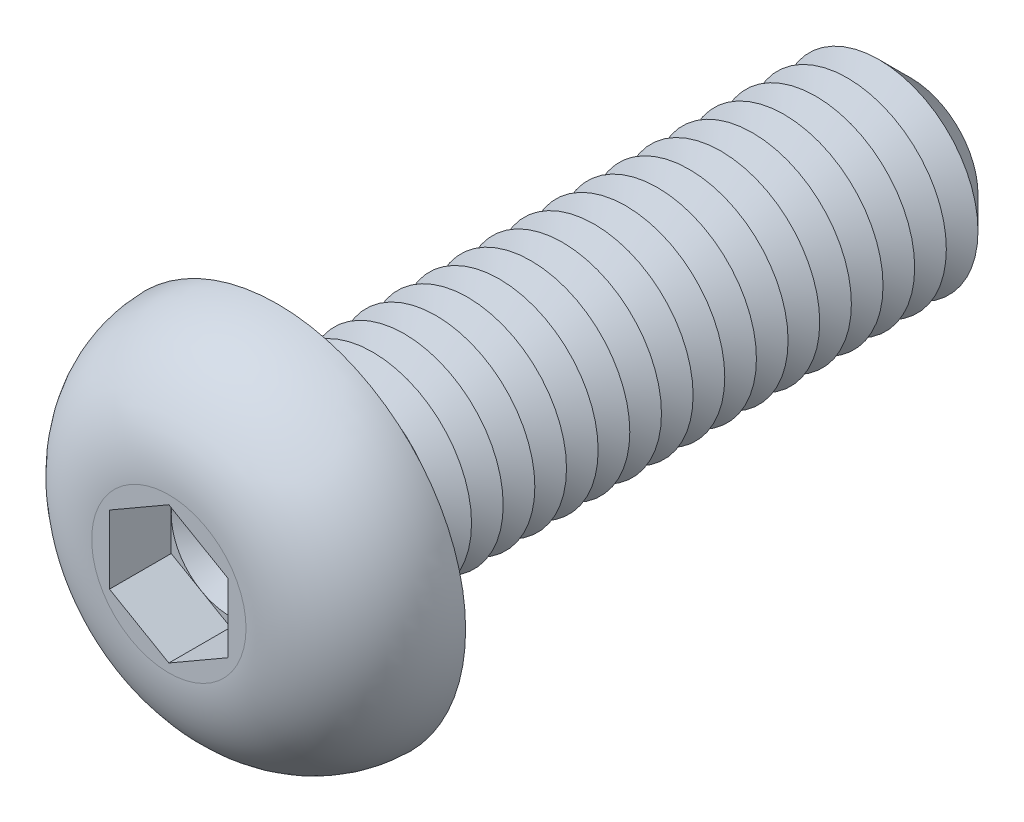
ISO-10303-21;
HEADER;
FILE_DESCRIPTION(('STEP AP214'),'2;1');
FILE_NAME('part.step','',(''),(''),'','','');
FILE_SCHEMA(('AUTOMOTIVE_DESIGN { 1 0 10303 214 1 1 1 1 }'));
ENDSEC;
DATA;
#1=APPLICATION_CONTEXT('core data for automotive mechanical design processes');
#2=APPLICATION_PROTOCOL_DEFINITION('international standard','automotive_design',2000,#1);
#3=PRODUCT_CONTEXT('',#1,'mechanical');
#4=PRODUCT('Part','Part','',(#3));
#5=PRODUCT_RELATED_PRODUCT_CATEGORY('part','',(#4));
#6=PRODUCT_DEFINITION_FORMATION('','',#4);
#7=PRODUCT_DEFINITION_CONTEXT('part definition',#1,'design');
#8=PRODUCT_DEFINITION('design','',#6,#7);
#9=PRODUCT_DEFINITION_SHAPE('','',#8);
#10=(LENGTH_UNIT() NAMED_UNIT(*) SI_UNIT(.MILLI.,.METRE.));
#11=(NAMED_UNIT(*) PLANE_ANGLE_UNIT() SI_UNIT($,.RADIAN.));
#12=(NAMED_UNIT(*) SI_UNIT($,.STERADIAN.) SOLID_ANGLE_UNIT());
#13=UNCERTAINTY_MEASURE_WITH_UNIT(LENGTH_MEASURE(1.E-05),#10,'distance_accuracy_value','');
#14=(GEOMETRIC_REPRESENTATION_CONTEXT(3) GLOBAL_UNCERTAINTY_ASSIGNED_CONTEXT((#13)) GLOBAL_UNIT_ASSIGNED_CONTEXT((#10,
#11,#12)) REPRESENTATION_CONTEXT('',''));
#15=CARTESIAN_POINT('',(0.,0.,0.));
#16=DIRECTION('',(0.,0.,1.));
#17=DIRECTION('',(1.,0.,0.));
#18=AXIS2_PLACEMENT_3D('',#15,#16,#17);
#19=CARTESIAN_POINT('',(0.,0.,1.19));
#20=DIRECTION('',(0.,0.,1.));
#21=DIRECTION('',(1.,0.,0.));
#22=AXIS2_PLACEMENT_3D('',#19,#20,#21);
#23=PLANE('',#22);
#24=CARTESIAN_POINT('',(0.,0.,1.19));
#25=DIRECTION('',(0.,0.,1.));
#26=DIRECTION('',(1.,0.,0.));
#27=AXIS2_PLACEMENT_3D('',#24,#25,#26);
#28=CIRCLE('',#27,1.5);
#29=CARTESIAN_POINT('',(1.5,0.,1.19));
#30=VERTEX_POINT('',#29);
#31=CARTESIAN_POINT('',(0.75,1.29903810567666,1.19));
#32=VERTEX_POINT('',#31);
#33=EDGE_CURVE('E117',#30,#32,#28,.T.);
#34=ORIENTED_EDGE('',*,*,#33,.F.);
#35=DIRECTION('',(0.,1.,0.));
#36=VECTOR('',#35,1.);
#37=CARTESIAN_POINT('',(1.5,-0.866025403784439,1.19));
#38=LINE('',#37,#36);
#39=CARTESIAN_POINT('',(1.5,0.86602540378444,1.19));
#40=VERTEX_POINT('',#39);
#41=EDGE_CURVE('E140',#30,#40,#38,.T.);
#42=ORIENTED_EDGE('',*,*,#41,.T.);
#43=DIRECTION('',(-0.866025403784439,0.5,0.));
#44=VECTOR('',#43,1.);
#45=CARTESIAN_POINT('',(1.5,0.86602540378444,1.19));
#46=LINE('',#45,#44);
#47=EDGE_CURVE('E135',#40,#32,#46,.T.);
#48=ORIENTED_EDGE('',*,*,#47,.T.);
#49=EDGE_LOOP('',(#34,#42,#48));
#50=FACE_BOUND('',#49,.T.);
#51=ADVANCED_FACE('F39',(#50),#23,.T.);
#52=CARTESIAN_POINT('',(0.,0.,1.19));
#53=DIRECTION('',(0.,0.,1.));
#54=DIRECTION('',(1.,0.,0.));
#55=AXIS2_PLACEMENT_3D('',#52,#53,#54);
#56=CIRCLE('',#55,1.5);
#57=CARTESIAN_POINT('',(-0.75,1.29903810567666,1.19));
#58=VERTEX_POINT('',#57);
#59=EDGE_CURVE('E11',#32,#58,#56,.T.);
#60=ORIENTED_EDGE('',*,*,#59,.F.);
#61=CARTESIAN_POINT('',(0.,1.73205080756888,1.19));
#62=VERTEX_POINT('',#61);
#63=EDGE_CURVE('E130',#32,#62,#46,.T.);
#64=ORIENTED_EDGE('',*,*,#63,.T.);
#65=DIRECTION('',(-0.866025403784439,-0.5,0.));
#66=VECTOR('',#65,1.);
#67=CARTESIAN_POINT('',(0.,1.73205080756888,1.19));
#68=LINE('',#67,#66);
#69=EDGE_CURVE('E132',#62,#58,#68,.T.);
#70=ORIENTED_EDGE('',*,*,#69,.T.);
#71=EDGE_LOOP('',(#60,#64,#70));
#72=FACE_BOUND('',#71,.T.);
#73=ADVANCED_FACE('F129',(#72),#23,.T.);
#74=CARTESIAN_POINT('',(-1.5,0.,1.19));
#75=VERTEX_POINT('',#74);
#76=EDGE_CURVE('E49',#58,#75,#56,.T.);
#77=ORIENTED_EDGE('',*,*,#76,.F.);
#78=CARTESIAN_POINT('',(-1.5,0.866025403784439,1.19));
#79=VERTEX_POINT('',#78);
#80=EDGE_CURVE('E143',#58,#79,#68,.T.);
#81=ORIENTED_EDGE('',*,*,#80,.T.);
#82=DIRECTION('',(0.,-1.,0.));
#83=VECTOR('',#82,1.);
#84=CARTESIAN_POINT('',(-1.5,0.866025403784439,1.19));
#85=LINE('',#84,#83);
#86=EDGE_CURVE('E154',#79,#75,#85,.T.);
#87=ORIENTED_EDGE('',*,*,#86,.T.);
#88=EDGE_LOOP('',(#77,#81,#87));
#89=FACE_BOUND('',#88,.T.);
#90=ADVANCED_FACE('F249',(#89),#23,.T.);
#91=CARTESIAN_POINT('',(-0.75,-1.29903810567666,1.19));
#92=VERTEX_POINT('',#91);
#93=EDGE_CURVE('E232',#75,#92,#56,.T.);
#94=ORIENTED_EDGE('',*,*,#93,.F.);
#95=CARTESIAN_POINT('',(-1.5,-0.866025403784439,1.19));
#96=VERTEX_POINT('',#95);
#97=EDGE_CURVE('E153',#75,#96,#85,.T.);
#98=ORIENTED_EDGE('',*,*,#97,.T.);
#99=DIRECTION('',(0.866025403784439,-0.5,0.));
#100=VECTOR('',#99,1.);
#101=CARTESIAN_POINT('',(-1.5,-0.866025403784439,1.19));
#102=LINE('',#101,#100);
#103=EDGE_CURVE('E159',#96,#92,#102,.T.);
#104=ORIENTED_EDGE('',*,*,#103,.T.);
#105=EDGE_LOOP('',(#94,#98,#104));
#106=FACE_BOUND('',#105,.T.);
#107=ADVANCED_FACE('F242',(#106),#23,.T.);
#108=CARTESIAN_POINT('',(0.75,-1.29903810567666,1.19));
#109=VERTEX_POINT('',#108);
#110=EDGE_CURVE('E56',#92,#109,#56,.T.);
#111=ORIENTED_EDGE('',*,*,#110,.F.);
#112=CARTESIAN_POINT('',(0.,-1.73205080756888,1.19));
#113=VERTEX_POINT('',#112);
#114=EDGE_CURVE('E158',#92,#113,#102,.T.);
#115=ORIENTED_EDGE('',*,*,#114,.T.);
#116=DIRECTION('',(0.866025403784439,0.5,0.));
#117=VECTOR('',#116,1.);
#118=CARTESIAN_POINT('',(0.,-1.73205080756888,1.19));
#119=LINE('',#118,#117);
#120=EDGE_CURVE('E164',#113,#109,#119,.T.);
#121=ORIENTED_EDGE('',*,*,#120,.T.);
#122=EDGE_LOOP('',(#111,#115,#121));
#123=FACE_BOUND('',#122,.T.);
#124=ADVANCED_FACE('F376',(#123),#23,.T.);
#125=CARTESIAN_POINT('',(0.,0.,-16.));
#126=DIRECTION('',(0.,0.,1.));
#127=DIRECTION('',(1.,0.,0.));
#128=AXIS2_PLACEMENT_3D('',#125,#126,#127);
#129=CYLINDRICAL_SURFACE('',#128,2.5);
#130=CARTESIAN_POINT('',(0.,0.,-0.399999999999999));
#131=DIRECTION('',(0.,0.,1.));
#132=DIRECTION('',(1.,0.,0.));
#133=AXIS2_PLACEMENT_3D('',#130,#131,#132);
#134=CIRCLE('',#133,2.5);
#135=CARTESIAN_POINT('',(2.5,0.,-0.399999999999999));
#136=VERTEX_POINT('',#135);
#137=EDGE_CURVE('E221',#136,#136,#134,.F.);
#138=ORIENTED_EDGE('',*,*,#137,.T.);
#139=EDGE_LOOP('',(#138));
#140=FACE_BOUND('',#139,.T.);
#141=CARTESIAN_POINT('',(0.,0.,-0.800000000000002));
#142=DIRECTION('',(0.,0.,1.));
#143=DIRECTION('',(1.,0.,0.));
#144=AXIS2_PLACEMENT_3D('',#141,#142,#143);
#145=CIRCLE('',#144,2.5);
#146=CARTESIAN_POINT('',(2.5,0.,-0.800000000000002));
#147=VERTEX_POINT('',#146);
#148=EDGE_CURVE('E149',#147,#147,#145,.T.);
#149=ORIENTED_EDGE('',*,*,#148,.T.);
#150=EDGE_LOOP('',(#149));
#151=FACE_BOUND('',#150,.T.);
#152=ADVANCED_FACE('F360',(#140,#151),#129,.T.);
#153=CARTESIAN_POINT('',(0.,4.75,0.));
#154=DIRECTION('',(0.,0.,1.));
#155=DIRECTION('',(1.,0.,0.));
#156=AXIS2_PLACEMENT_3D('',#153,#154,#155);
#157=PLANE('',#156);
#158=CARTESIAN_POINT('',(0.,0.,0.));
#159=DIRECTION('',(0.,0.,1.));
#160=DIRECTION('',(1.,0.,0.));
#161=AXIS2_PLACEMENT_3D('',#158,#159,#160);
#162=CIRCLE('',#161,2.9);
#163=CARTESIAN_POINT('',(2.9,0.,0.));
#164=VERTEX_POINT('',#163);
#165=EDGE_CURVE('E224',#164,#164,#162,.T.);
#166=ORIENTED_EDGE('',*,*,#165,.T.);
#167=EDGE_LOOP('',(#166));
#168=FACE_BOUND('',#167,.T.);
#169=CARTESIAN_POINT('',(0.,0.,0.));
#170=DIRECTION('',(0.,0.,1.));
#171=DIRECTION('',(1.,0.,0.));
#172=AXIS2_PLACEMENT_3D('',#169,#170,#171);
#173=CIRCLE('',#172,4.75);
#174=CARTESIAN_POINT('',(4.75,0.,0.));
#175=VERTEX_POINT('',#174);
#176=EDGE_CURVE('E196',#175,#175,#173,.T.);
#177=ORIENTED_EDGE('',*,*,#176,.F.);
#178=EDGE_LOOP('',(#177));
#179=FACE_BOUND('',#178,.T.);
#180=ADVANCED_FACE('F406',(#168,#179),#157,.F.);
#181=CARTESIAN_POINT('',(0.,0.,2.75));
#182=DIRECTION('',(0.,0.,-1.));
#183=DIRECTION('',(-1.,0.,0.));
#184=AXIS2_PLACEMENT_3D('',#181,#182,#183);
#185=PLANE('',#184);
#186=DIRECTION('',(-0.866025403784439,-0.5,0.));
#187=VECTOR('',#186,1.);
#188=CARTESIAN_POINT('',(0.,1.73205080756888,2.75));
#189=LINE('',#188,#187);
#190=CARTESIAN_POINT('',(0.,1.73205080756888,2.75));
#191=VERTEX_POINT('',#190);
#192=CARTESIAN_POINT('',(-1.5,0.866025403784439,2.75));
#193=VERTEX_POINT('',#192);
#194=EDGE_CURVE('E174',#191,#193,#189,.T.);
#195=ORIENTED_EDGE('',*,*,#194,.F.);
#196=DIRECTION('',(-0.866025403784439,0.5,0.));
#197=VECTOR('',#196,1.);
#198=CARTESIAN_POINT('',(1.5,0.86602540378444,2.75));
#199=LINE('',#198,#197);
#200=CARTESIAN_POINT('',(1.5,0.86602540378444,2.75));
#201=VERTEX_POINT('',#200);
#202=EDGE_CURVE('E64',#201,#191,#199,.T.);
#203=ORIENTED_EDGE('',*,*,#202,.F.);
#204=DIRECTION('',(0.,1.,0.));
#205=VECTOR('',#204,1.);
#206=CARTESIAN_POINT('',(1.5,-0.866025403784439,2.75));
#207=LINE('',#206,#205);
#208=CARTESIAN_POINT('',(1.5,-0.866025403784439,2.75));
#209=VERTEX_POINT('',#208);
#210=EDGE_CURVE('E138',#209,#201,#207,.T.);
#211=ORIENTED_EDGE('',*,*,#210,.F.);
#212=DIRECTION('',(0.866025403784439,0.5,0.));
#213=VECTOR('',#212,1.);
#214=CARTESIAN_POINT('',(0.,-1.73205080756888,2.75));
#215=LINE('',#214,#213);
#216=CARTESIAN_POINT('',(0.,-1.73205080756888,2.75));
#217=VERTEX_POINT('',#216);
#218=EDGE_CURVE('E186',#217,#209,#215,.T.);
#219=ORIENTED_EDGE('',*,*,#218,.F.);
#220=DIRECTION('',(0.866025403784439,-0.5,0.));
#221=VECTOR('',#220,1.);
#222=CARTESIAN_POINT('',(-1.5,-0.866025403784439,2.75));
#223=LINE('',#222,#221);
#224=CARTESIAN_POINT('',(-1.5,-0.866025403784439,2.75));
#225=VERTEX_POINT('',#224);
#226=EDGE_CURVE('E182',#225,#217,#223,.T.);
#227=ORIENTED_EDGE('',*,*,#226,.F.);
#228=DIRECTION('',(0.,-1.,0.));
#229=VECTOR('',#228,1.);
#230=CARTESIAN_POINT('',(-1.5,0.866025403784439,2.75));
#231=LINE('',#230,#229);
#232=EDGE_CURVE('E178',#193,#225,#231,.T.);
#233=ORIENTED_EDGE('',*,*,#232,.F.);
#234=EDGE_LOOP('',(#195,#203,#211,#219,#227,#233));
#235=FACE_BOUND('',#234,.T.);
#236=CARTESIAN_POINT('',(0.,0.,2.75));
#237=DIRECTION('',(0.,0.,1.));
#238=DIRECTION('',(1.,0.,0.));
#239=AXIS2_PLACEMENT_3D('',#236,#237,#238);
#240=CIRCLE('',#239,1.95044646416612);
#241=CARTESIAN_POINT('',(1.95044646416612,0.,2.75));
#242=VERTEX_POINT('',#241);
#243=EDGE_CURVE('E213',#242,#242,#240,.T.);
#244=ORIENTED_EDGE('',*,*,#243,.T.);
#245=EDGE_LOOP('',(#244));
#246=FACE_BOUND('',#245,.T.);
#247=ADVANCED_FACE('F258',(#235,#246),#185,.F.);
#248=CARTESIAN_POINT('',(0.,0.,-0.0500000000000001));
#249=DIRECTION('',(0.,0.,1.));
#250=DIRECTION('',(1.,0.,0.));
#251=AXIS2_PLACEMENT_3D('',#248,#249,#250);
#252=DEGENERATE_TOROIDAL_SURFACE('',#251,1.95044646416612,2.8,.T.);
#253=ORIENTED_EDGE('',*,*,#243,.F.);
#254=EDGE_LOOP('',(#253));
#255=FACE_BOUND('',#254,.T.);
#256=ORIENTED_EDGE('',*,*,#176,.T.);
#257=EDGE_LOOP('',(#256));
#258=FACE_BOUND('',#257,.T.);
#259=ADVANCED_FACE('F400',(#255,#258),#252,.T.);
#260=CARTESIAN_POINT('',(1.5,0.86602540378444,1.19));
#261=DIRECTION('',(0.5,0.866025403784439,0.));
#262=DIRECTION('',(-0.866025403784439,0.5,0.));
#263=AXIS2_PLACEMENT_3D('',#260,#261,#262);
#264=PLANE('',#263);
#265=ORIENTED_EDGE('',*,*,#202,.T.);
#266=DIRECTION('',(0.,0.,1.));
#267=VECTOR('',#266,1.);
#268=CARTESIAN_POINT('',(0.,1.73205080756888,1.19));
#269=LINE('',#268,#267);
#270=EDGE_CURVE('E136',#62,#191,#269,.T.);
#271=ORIENTED_EDGE('',*,*,#270,.F.);
#272=ORIENTED_EDGE('',*,*,#63,.F.);
#273=ORIENTED_EDGE('',*,*,#47,.F.);
#274=DIRECTION('',(0.,0.,1.));
#275=VECTOR('',#274,1.);
#276=CARTESIAN_POINT('',(1.5,0.86602540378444,1.19));
#277=LINE('',#276,#275);
#278=EDGE_CURVE('E193',#40,#201,#277,.T.);
#279=ORIENTED_EDGE('',*,*,#278,.T.);
#280=EDGE_LOOP('',(#265,#271,#272,#273,#279));
#281=FACE_BOUND('',#280,.T.);
#282=ADVANCED_FACE('F134',(#281),#264,.F.);
#283=CARTESIAN_POINT('',(1.5,-0.866025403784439,1.19));
#284=DIRECTION('',(1.,0.,0.));
#285=DIRECTION('',(0.,1.,0.));
#286=AXIS2_PLACEMENT_3D('',#283,#284,#285);
#287=PLANE('',#286);
#288=ORIENTED_EDGE('',*,*,#210,.T.);
#289=ORIENTED_EDGE('',*,*,#278,.F.);
#290=ORIENTED_EDGE('',*,*,#41,.F.);
#291=CARTESIAN_POINT('',(1.5,-0.866025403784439,1.19));
#292=VERTEX_POINT('',#291);
#293=EDGE_CURVE('E168',#292,#30,#38,.T.);
#294=ORIENTED_EDGE('',*,*,#293,.F.);
#295=DIRECTION('',(0.,0.,1.));
#296=VECTOR('',#295,1.);
#297=CARTESIAN_POINT('',(1.5,-0.866025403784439,1.19));
#298=LINE('',#297,#296);
#299=EDGE_CURVE('E197',#292,#209,#298,.T.);
#300=ORIENTED_EDGE('',*,*,#299,.T.);
#301=EDGE_LOOP('',(#288,#289,#290,#294,#300));
#302=FACE_BOUND('',#301,.T.);
#303=ADVANCED_FACE('F384',(#302),#287,.F.);
#304=CARTESIAN_POINT('',(0.,-1.73205080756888,1.19));
#305=DIRECTION('',(0.5,-0.866025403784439,0.));
#306=DIRECTION('',(0.866025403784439,0.5,0.));
#307=AXIS2_PLACEMENT_3D('',#304,#305,#306);
#308=PLANE('',#307);
#309=ORIENTED_EDGE('',*,*,#218,.T.);
#310=ORIENTED_EDGE('',*,*,#299,.F.);
#311=EDGE_CURVE('E163',#109,#292,#119,.T.);
#312=ORIENTED_EDGE('',*,*,#311,.F.);
#313=ORIENTED_EDGE('',*,*,#120,.F.);
#314=DIRECTION('',(0.,0.,1.));
#315=VECTOR('',#314,1.);
#316=CARTESIAN_POINT('',(0.,-1.73205080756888,1.19));
#317=LINE('',#316,#315);
#318=EDGE_CURVE('E200',#113,#217,#317,.T.);
#319=ORIENTED_EDGE('',*,*,#318,.T.);
#320=EDGE_LOOP('',(#309,#310,#312,#313,#319));
#321=FACE_BOUND('',#320,.T.);
#322=ADVANCED_FACE('F387',(#321),#308,.F.);
#323=CARTESIAN_POINT('',(-1.5,-0.866025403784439,1.19));
#324=DIRECTION('',(-0.5,-0.866025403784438,0.));
#325=DIRECTION('',(0.866025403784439,-0.5,0.));
#326=AXIS2_PLACEMENT_3D('',#323,#324,#325);
#327=PLANE('',#326);
#328=ORIENTED_EDGE('',*,*,#226,.T.);
#329=ORIENTED_EDGE('',*,*,#318,.F.);
#330=ORIENTED_EDGE('',*,*,#114,.F.);
#331=ORIENTED_EDGE('',*,*,#103,.F.);
#332=DIRECTION('',(0.,0.,1.));
#333=VECTOR('',#332,1.);
#334=CARTESIAN_POINT('',(-1.5,-0.866025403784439,1.19));
#335=LINE('',#334,#333);
#336=EDGE_CURVE('E203',#96,#225,#335,.T.);
#337=ORIENTED_EDGE('',*,*,#336,.T.);
#338=EDGE_LOOP('',(#328,#329,#330,#331,#337));
#339=FACE_BOUND('',#338,.T.);
#340=ADVANCED_FACE('F263',(#339),#327,.F.);
#341=CARTESIAN_POINT('',(-1.5,0.866025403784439,1.19));
#342=DIRECTION('',(-1.,0.,0.));
#343=DIRECTION('',(0.,-1.,0.));
#344=AXIS2_PLACEMENT_3D('',#341,#342,#343);
#345=PLANE('',#344);
#346=ORIENTED_EDGE('',*,*,#232,.T.);
#347=ORIENTED_EDGE('',*,*,#336,.F.);
#348=ORIENTED_EDGE('',*,*,#97,.F.);
#349=ORIENTED_EDGE('',*,*,#86,.F.);
#350=DIRECTION('',(0.,0.,1.));
#351=VECTOR('',#350,1.);
#352=CARTESIAN_POINT('',(-1.5,0.866025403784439,1.19));
#353=LINE('',#352,#351);
#354=EDGE_CURVE('E205',#79,#193,#353,.T.);
#355=ORIENTED_EDGE('',*,*,#354,.T.);
#356=EDGE_LOOP('',(#346,#347,#348,#349,#355));
#357=FACE_BOUND('',#356,.T.);
#358=ADVANCED_FACE('F247',(#357),#345,.F.);
#359=CARTESIAN_POINT('',(0.,1.73205080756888,1.19));
#360=DIRECTION('',(-0.5,0.866025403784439,0.));
#361=DIRECTION('',(-0.866025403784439,-0.5,0.));
#362=AXIS2_PLACEMENT_3D('',#359,#360,#361);
#363=PLANE('',#362);
#364=ORIENTED_EDGE('',*,*,#194,.T.);
#365=ORIENTED_EDGE('',*,*,#354,.F.);
#366=ORIENTED_EDGE('',*,*,#80,.F.);
#367=ORIENTED_EDGE('',*,*,#69,.F.);
#368=ORIENTED_EDGE('',*,*,#270,.T.);
#369=EDGE_LOOP('',(#364,#365,#366,#367,#368));
#370=FACE_BOUND('',#369,.T.);
#371=ADVANCED_FACE('F252',(#370),#363,.F.);
#372=EDGE_CURVE('E43',#109,#30,#56,.T.);
#373=ORIENTED_EDGE('',*,*,#372,.F.);
#374=ORIENTED_EDGE('',*,*,#311,.T.);
#375=ORIENTED_EDGE('',*,*,#293,.T.);
#376=EDGE_LOOP('',(#373,#374,#375));
#377=FACE_BOUND('',#376,.T.);
#378=ADVANCED_FACE('F365',(#377),#23,.T.);
#379=CARTESIAN_POINT('',(0.,0.,-0.800000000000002));
#380=DIRECTION('',(0.,0.,1.));
#381=DIRECTION('',(1.,0.,0.));
#382=AXIS2_PLACEMENT_3D('',#379,#380,#381);
#383=CONICAL_SURFACE('',#382,2.5,1.0471975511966);
#384=CARTESIAN_POINT('',(0.,0.,-1.2));
#385=DIRECTION('',(0.,0.,1.));
#386=DIRECTION('',(1.,0.,0.));
#387=AXIS2_PLACEMENT_3D('',#384,#385,#386);
#388=CIRCLE('',#387,1.80717967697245);
#389=CARTESIAN_POINT('',(1.80717967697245,0.,-1.2));
#390=VERTEX_POINT('',#389);
#391=EDGE_CURVE('E351',#390,#390,#388,.T.);
#392=ORIENTED_EDGE('',*,*,#391,.T.);
#393=EDGE_LOOP('',(#392));
#394=FACE_BOUND('',#393,.T.);
#395=ORIENTED_EDGE('',*,*,#148,.F.);
#396=EDGE_LOOP('',(#395));
#397=FACE_BOUND('',#396,.T.);
#398=ADVANCED_FACE('F362',(#394,#397),#383,.T.);
#399=CARTESIAN_POINT('',(0.,0.,-1.2));
#400=DIRECTION('',(0.,0.,-1.));
#401=DIRECTION('',(-1.,0.,0.));
#402=AXIS2_PLACEMENT_3D('',#399,#400,#401);
#403=CONICAL_SURFACE('',#402,1.80717967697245,1.04719755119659);
#404=CARTESIAN_POINT('',(0.,0.,-1.6));
#405=DIRECTION('',(0.,0.,1.));
#406=DIRECTION('',(1.,0.,0.));
#407=AXIS2_PLACEMENT_3D('',#404,#405,#406);
#408=CIRCLE('',#407,2.5);
#409=CARTESIAN_POINT('',(2.5,0.,-1.6));
#410=VERTEX_POINT('',#409);
#411=EDGE_CURVE('E348',#410,#410,#408,.T.);
#412=ORIENTED_EDGE('',*,*,#411,.T.);
#413=EDGE_LOOP('',(#412));
#414=FACE_BOUND('',#413,.T.);
#415=ORIENTED_EDGE('',*,*,#391,.F.);
#416=EDGE_LOOP('',(#415));
#417=FACE_BOUND('',#416,.T.);
#418=ADVANCED_FACE('F364',(#414,#417),#403,.T.);
#419=CARTESIAN_POINT('',(0.,0.,-1.6));
#420=DIRECTION('',(0.,0.,1.));
#421=DIRECTION('',(1.,0.,0.));
#422=AXIS2_PLACEMENT_3D('',#419,#420,#421);
#423=CONICAL_SURFACE('',#422,2.5,1.0471975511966);
#424=CARTESIAN_POINT('',(0.,0.,-2.));
#425=DIRECTION('',(0.,0.,1.));
#426=DIRECTION('',(1.,0.,0.));
#427=AXIS2_PLACEMENT_3D('',#424,#425,#426);
#428=CIRCLE('',#427,1.80717967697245);
#429=CARTESIAN_POINT('',(1.80717967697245,0.,-2.));
#430=VERTEX_POINT('',#429);
#431=EDGE_CURVE('E344',#430,#430,#428,.T.);
#432=ORIENTED_EDGE('',*,*,#431,.T.);
#433=EDGE_LOOP('',(#432));
#434=FACE_BOUND('',#433,.T.);
#435=ORIENTED_EDGE('',*,*,#411,.F.);
#436=EDGE_LOOP('',(#435));
#437=FACE_BOUND('',#436,.T.);
#438=ADVANCED_FACE('F371',(#434,#437),#423,.T.);
#439=CARTESIAN_POINT('',(0.,0.,-2.));
#440=DIRECTION('',(0.,0.,-1.));
#441=DIRECTION('',(-1.,0.,0.));
#442=AXIS2_PLACEMENT_3D('',#439,#440,#441);
#443=CONICAL_SURFACE('',#442,1.80717967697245,1.04719755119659);
#444=CARTESIAN_POINT('',(0.,0.,-2.4));
#445=DIRECTION('',(0.,0.,1.));
#446=DIRECTION('',(1.,0.,0.));
#447=AXIS2_PLACEMENT_3D('',#444,#445,#446);
#448=CIRCLE('',#447,2.5);
#449=CARTESIAN_POINT('',(2.5,0.,-2.4));
#450=VERTEX_POINT('',#449);
#451=EDGE_CURVE('E340',#450,#450,#448,.T.);
#452=ORIENTED_EDGE('',*,*,#451,.T.);
#453=EDGE_LOOP('',(#452));
#454=FACE_BOUND('',#453,.T.);
#455=ORIENTED_EDGE('',*,*,#431,.F.);
#456=EDGE_LOOP('',(#455));
#457=FACE_BOUND('',#456,.T.);
#458=ADVANCED_FACE('F564',(#454,#457),#443,.T.);
#459=CARTESIAN_POINT('',(0.,0.,-2.4));
#460=DIRECTION('',(0.,0.,1.));
#461=DIRECTION('',(1.,0.,0.));
#462=AXIS2_PLACEMENT_3D('',#459,#460,#461);
#463=CONICAL_SURFACE('',#462,2.5,1.0471975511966);
#464=CARTESIAN_POINT('',(0.,0.,-2.8));
#465=DIRECTION('',(0.,0.,1.));
#466=DIRECTION('',(1.,0.,0.));
#467=AXIS2_PLACEMENT_3D('',#464,#465,#466);
#468=CIRCLE('',#467,1.80717967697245);
#469=CARTESIAN_POINT('',(1.80717967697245,0.,-2.8));
#470=VERTEX_POINT('',#469);
#471=EDGE_CURVE('E336',#470,#470,#468,.T.);
#472=ORIENTED_EDGE('',*,*,#471,.T.);
#473=EDGE_LOOP('',(#472));
#474=FACE_BOUND('',#473,.T.);
#475=ORIENTED_EDGE('',*,*,#451,.F.);
#476=EDGE_LOOP('',(#475));
#477=FACE_BOUND('',#476,.T.);
#478=ADVANCED_FACE('F560',(#474,#477),#463,.T.);
#479=CARTESIAN_POINT('',(0.,0.,-2.8));
#480=DIRECTION('',(0.,0.,-1.));
#481=DIRECTION('',(-1.,0.,0.));
#482=AXIS2_PLACEMENT_3D('',#479,#480,#481);
#483=CONICAL_SURFACE('',#482,1.80717967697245,1.04719755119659);
#484=CARTESIAN_POINT('',(0.,0.,-3.2));
#485=DIRECTION('',(0.,0.,1.));
#486=DIRECTION('',(1.,0.,0.));
#487=AXIS2_PLACEMENT_3D('',#484,#485,#486);
#488=CIRCLE('',#487,2.5);
#489=CARTESIAN_POINT('',(2.5,0.,-3.2));
#490=VERTEX_POINT('',#489);
#491=EDGE_CURVE('E332',#490,#490,#488,.T.);
#492=ORIENTED_EDGE('',*,*,#491,.T.);
#493=EDGE_LOOP('',(#492));
#494=FACE_BOUND('',#493,.T.);
#495=ORIENTED_EDGE('',*,*,#471,.F.);
#496=EDGE_LOOP('',(#495));
#497=FACE_BOUND('',#496,.T.);
#498=ADVANCED_FACE('F556',(#494,#497),#483,.T.);
#499=CARTESIAN_POINT('',(0.,0.,-3.2));
#500=DIRECTION('',(0.,0.,1.));
#501=DIRECTION('',(1.,0.,0.));
#502=AXIS2_PLACEMENT_3D('',#499,#500,#501);
#503=CONICAL_SURFACE('',#502,2.5,1.0471975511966);
#504=CARTESIAN_POINT('',(0.,0.,-3.6));
#505=DIRECTION('',(0.,0.,1.));
#506=DIRECTION('',(1.,0.,0.));
#507=AXIS2_PLACEMENT_3D('',#504,#505,#506);
#508=CIRCLE('',#507,1.80717967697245);
#509=CARTESIAN_POINT('',(1.80717967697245,0.,-3.6));
#510=VERTEX_POINT('',#509);
#511=EDGE_CURVE('E328',#510,#510,#508,.T.);
#512=ORIENTED_EDGE('',*,*,#511,.T.);
#513=EDGE_LOOP('',(#512));
#514=FACE_BOUND('',#513,.T.);
#515=ORIENTED_EDGE('',*,*,#491,.F.);
#516=EDGE_LOOP('',(#515));
#517=FACE_BOUND('',#516,.T.);
#518=ADVANCED_FACE('F552',(#514,#517),#503,.T.);
#519=CARTESIAN_POINT('',(0.,0.,-3.6));
#520=DIRECTION('',(0.,0.,-1.));
#521=DIRECTION('',(-1.,0.,0.));
#522=AXIS2_PLACEMENT_3D('',#519,#520,#521);
#523=CONICAL_SURFACE('',#522,1.80717967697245,1.04719755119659);
#524=CARTESIAN_POINT('',(0.,0.,-4.));
#525=DIRECTION('',(0.,0.,1.));
#526=DIRECTION('',(1.,0.,0.));
#527=AXIS2_PLACEMENT_3D('',#524,#525,#526);
#528=CIRCLE('',#527,2.5);
#529=CARTESIAN_POINT('',(2.5,0.,-4.));
#530=VERTEX_POINT('',#529);
#531=EDGE_CURVE('E324',#530,#530,#528,.T.);
#532=ORIENTED_EDGE('',*,*,#531,.T.);
#533=EDGE_LOOP('',(#532));
#534=FACE_BOUND('',#533,.T.);
#535=ORIENTED_EDGE('',*,*,#511,.F.);
#536=EDGE_LOOP('',(#535));
#537=FACE_BOUND('',#536,.T.);
#538=ADVANCED_FACE('F548',(#534,#537),#523,.T.);
#539=CARTESIAN_POINT('',(0.,0.,-4.));
#540=DIRECTION('',(0.,0.,1.));
#541=DIRECTION('',(1.,0.,0.));
#542=AXIS2_PLACEMENT_3D('',#539,#540,#541);
#543=CONICAL_SURFACE('',#542,2.5,1.0471975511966);
#544=CARTESIAN_POINT('',(0.,0.,-4.4));
#545=DIRECTION('',(0.,0.,1.));
#546=DIRECTION('',(1.,0.,0.));
#547=AXIS2_PLACEMENT_3D('',#544,#545,#546);
#548=CIRCLE('',#547,1.80717967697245);
#549=CARTESIAN_POINT('',(1.80717967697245,0.,-4.4));
#550=VERTEX_POINT('',#549);
#551=EDGE_CURVE('E320',#550,#550,#548,.T.);
#552=ORIENTED_EDGE('',*,*,#551,.T.);
#553=EDGE_LOOP('',(#552));
#554=FACE_BOUND('',#553,.T.);
#555=ORIENTED_EDGE('',*,*,#531,.F.);
#556=EDGE_LOOP('',(#555));
#557=FACE_BOUND('',#556,.T.);
#558=ADVANCED_FACE('F544',(#554,#557),#543,.T.);
#559=CARTESIAN_POINT('',(0.,0.,-4.4));
#560=DIRECTION('',(0.,0.,-1.));
#561=DIRECTION('',(-1.,0.,0.));
#562=AXIS2_PLACEMENT_3D('',#559,#560,#561);
#563=CONICAL_SURFACE('',#562,1.80717967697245,1.04719755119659);
#564=CARTESIAN_POINT('',(0.,0.,-4.8));
#565=DIRECTION('',(0.,0.,1.));
#566=DIRECTION('',(1.,0.,0.));
#567=AXIS2_PLACEMENT_3D('',#564,#565,#566);
#568=CIRCLE('',#567,2.5);
#569=CARTESIAN_POINT('',(2.5,0.,-4.8));
#570=VERTEX_POINT('',#569);
#571=EDGE_CURVE('E316',#570,#570,#568,.T.);
#572=ORIENTED_EDGE('',*,*,#571,.T.);
#573=EDGE_LOOP('',(#572));
#574=FACE_BOUND('',#573,.T.);
#575=ORIENTED_EDGE('',*,*,#551,.F.);
#576=EDGE_LOOP('',(#575));
#577=FACE_BOUND('',#576,.T.);
#578=ADVANCED_FACE('F540',(#574,#577),#563,.T.);
#579=CARTESIAN_POINT('',(0.,0.,-4.8));
#580=DIRECTION('',(0.,0.,1.));
#581=DIRECTION('',(1.,0.,0.));
#582=AXIS2_PLACEMENT_3D('',#579,#580,#581);
#583=CONICAL_SURFACE('',#582,2.5,1.0471975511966);
#584=CARTESIAN_POINT('',(0.,0.,-5.2));
#585=DIRECTION('',(0.,0.,1.));
#586=DIRECTION('',(1.,0.,0.));
#587=AXIS2_PLACEMENT_3D('',#584,#585,#586);
#588=CIRCLE('',#587,1.80717967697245);
#589=CARTESIAN_POINT('',(1.80717967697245,0.,-5.2));
#590=VERTEX_POINT('',#589);
#591=EDGE_CURVE('E312',#590,#590,#588,.T.);
#592=ORIENTED_EDGE('',*,*,#591,.T.);
#593=EDGE_LOOP('',(#592));
#594=FACE_BOUND('',#593,.T.);
#595=ORIENTED_EDGE('',*,*,#571,.F.);
#596=EDGE_LOOP('',(#595));
#597=FACE_BOUND('',#596,.T.);
#598=ADVANCED_FACE('F536',(#594,#597),#583,.T.);
#599=CARTESIAN_POINT('',(0.,0.,-5.2));
#600=DIRECTION('',(0.,0.,-1.));
#601=DIRECTION('',(-1.,0.,0.));
#602=AXIS2_PLACEMENT_3D('',#599,#600,#601);
#603=CONICAL_SURFACE('',#602,1.80717967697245,1.04719755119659);
#604=CARTESIAN_POINT('',(0.,0.,-5.6));
#605=DIRECTION('',(0.,0.,1.));
#606=DIRECTION('',(1.,0.,0.));
#607=AXIS2_PLACEMENT_3D('',#604,#605,#606);
#608=CIRCLE('',#607,2.5);
#609=CARTESIAN_POINT('',(2.5,0.,-5.6));
#610=VERTEX_POINT('',#609);
#611=EDGE_CURVE('E308',#610,#610,#608,.T.);
#612=ORIENTED_EDGE('',*,*,#611,.T.);
#613=EDGE_LOOP('',(#612));
#614=FACE_BOUND('',#613,.T.);
#615=ORIENTED_EDGE('',*,*,#591,.F.);
#616=EDGE_LOOP('',(#615));
#617=FACE_BOUND('',#616,.T.);
#618=ADVANCED_FACE('F532',(#614,#617),#603,.T.);
#619=CARTESIAN_POINT('',(0.,0.,-5.6));
#620=DIRECTION('',(0.,0.,1.));
#621=DIRECTION('',(1.,0.,0.));
#622=AXIS2_PLACEMENT_3D('',#619,#620,#621);
#623=CONICAL_SURFACE('',#622,2.5,1.0471975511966);
#624=CARTESIAN_POINT('',(0.,0.,-6.));
#625=DIRECTION('',(0.,0.,1.));
#626=DIRECTION('',(1.,0.,0.));
#627=AXIS2_PLACEMENT_3D('',#624,#625,#626);
#628=CIRCLE('',#627,1.80717967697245);
#629=CARTESIAN_POINT('',(1.80717967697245,0.,-6.));
#630=VERTEX_POINT('',#629);
#631=EDGE_CURVE('E304',#630,#630,#628,.T.);
#632=ORIENTED_EDGE('',*,*,#631,.T.);
#633=EDGE_LOOP('',(#632));
#634=FACE_BOUND('',#633,.T.);
#635=ORIENTED_EDGE('',*,*,#611,.F.);
#636=EDGE_LOOP('',(#635));
#637=FACE_BOUND('',#636,.T.);
#638=ADVANCED_FACE('F528',(#634,#637),#623,.T.);
#639=CARTESIAN_POINT('',(0.,0.,-6.));
#640=DIRECTION('',(0.,0.,-1.));
#641=DIRECTION('',(-1.,0.,0.));
#642=AXIS2_PLACEMENT_3D('',#639,#640,#641);
#643=CONICAL_SURFACE('',#642,1.80717967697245,1.04719755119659);
#644=CARTESIAN_POINT('',(0.,0.,-6.4));
#645=DIRECTION('',(0.,0.,1.));
#646=DIRECTION('',(1.,0.,0.));
#647=AXIS2_PLACEMENT_3D('',#644,#645,#646);
#648=CIRCLE('',#647,2.5);
#649=CARTESIAN_POINT('',(2.5,0.,-6.4));
#650=VERTEX_POINT('',#649);
#651=EDGE_CURVE('E300',#650,#650,#648,.T.);
#652=ORIENTED_EDGE('',*,*,#651,.T.);
#653=EDGE_LOOP('',(#652));
#654=FACE_BOUND('',#653,.T.);
#655=ORIENTED_EDGE('',*,*,#631,.F.);
#656=EDGE_LOOP('',(#655));
#657=FACE_BOUND('',#656,.T.);
#658=ADVANCED_FACE('F524',(#654,#657),#643,.T.);
#659=CARTESIAN_POINT('',(0.,0.,-6.4));
#660=DIRECTION('',(0.,0.,1.));
#661=DIRECTION('',(1.,0.,0.));
#662=AXIS2_PLACEMENT_3D('',#659,#660,#661);
#663=CONICAL_SURFACE('',#662,2.5,1.0471975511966);
#664=CARTESIAN_POINT('',(0.,0.,-6.8));
#665=DIRECTION('',(0.,0.,1.));
#666=DIRECTION('',(1.,0.,0.));
#667=AXIS2_PLACEMENT_3D('',#664,#665,#666);
#668=CIRCLE('',#667,1.80717967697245);
#669=CARTESIAN_POINT('',(1.80717967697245,0.,-6.8));
#670=VERTEX_POINT('',#669);
#671=EDGE_CURVE('E296',#670,#670,#668,.T.);
#672=ORIENTED_EDGE('',*,*,#671,.T.);
#673=EDGE_LOOP('',(#672));
#674=FACE_BOUND('',#673,.T.);
#675=ORIENTED_EDGE('',*,*,#651,.F.);
#676=EDGE_LOOP('',(#675));
#677=FACE_BOUND('',#676,.T.);
#678=ADVANCED_FACE('F520',(#674,#677),#663,.T.);
#679=CARTESIAN_POINT('',(0.,0.,-6.8));
#680=DIRECTION('',(0.,0.,-1.));
#681=DIRECTION('',(-1.,0.,0.));
#682=AXIS2_PLACEMENT_3D('',#679,#680,#681);
#683=CONICAL_SURFACE('',#682,1.80717967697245,1.04719755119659);
#684=CARTESIAN_POINT('',(0.,0.,-7.2));
#685=DIRECTION('',(0.,0.,1.));
#686=DIRECTION('',(1.,0.,0.));
#687=AXIS2_PLACEMENT_3D('',#684,#685,#686);
#688=CIRCLE('',#687,2.5);
#689=CARTESIAN_POINT('',(2.5,0.,-7.2));
#690=VERTEX_POINT('',#689);
#691=EDGE_CURVE('E292',#690,#690,#688,.T.);
#692=ORIENTED_EDGE('',*,*,#691,.T.);
#693=EDGE_LOOP('',(#692));
#694=FACE_BOUND('',#693,.T.);
#695=ORIENTED_EDGE('',*,*,#671,.F.);
#696=EDGE_LOOP('',(#695));
#697=FACE_BOUND('',#696,.T.);
#698=ADVANCED_FACE('F516',(#694,#697),#683,.T.);
#699=CARTESIAN_POINT('',(0.,0.,-7.2));
#700=DIRECTION('',(0.,0.,1.));
#701=DIRECTION('',(1.,0.,0.));
#702=AXIS2_PLACEMENT_3D('',#699,#700,#701);
#703=CONICAL_SURFACE('',#702,2.5,1.0471975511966);
#704=CARTESIAN_POINT('',(0.,0.,-7.6));
#705=DIRECTION('',(0.,0.,1.));
#706=DIRECTION('',(1.,0.,0.));
#707=AXIS2_PLACEMENT_3D('',#704,#705,#706);
#708=CIRCLE('',#707,1.80717967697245);
#709=CARTESIAN_POINT('',(1.80717967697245,0.,-7.6));
#710=VERTEX_POINT('',#709);
#711=EDGE_CURVE('E288',#710,#710,#708,.T.);
#712=ORIENTED_EDGE('',*,*,#711,.T.);
#713=EDGE_LOOP('',(#712));
#714=FACE_BOUND('',#713,.T.);
#715=ORIENTED_EDGE('',*,*,#691,.F.);
#716=EDGE_LOOP('',(#715));
#717=FACE_BOUND('',#716,.T.);
#718=ADVANCED_FACE('F512',(#714,#717),#703,.T.);
#719=CARTESIAN_POINT('',(0.,0.,-7.6));
#720=DIRECTION('',(0.,0.,-1.));
#721=DIRECTION('',(-1.,0.,0.));
#722=AXIS2_PLACEMENT_3D('',#719,#720,#721);
#723=CONICAL_SURFACE('',#722,1.80717967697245,1.04719755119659);
#724=CARTESIAN_POINT('',(0.,0.,-8.));
#725=DIRECTION('',(0.,0.,1.));
#726=DIRECTION('',(1.,0.,0.));
#727=AXIS2_PLACEMENT_3D('',#724,#725,#726);
#728=CIRCLE('',#727,2.5);
#729=CARTESIAN_POINT('',(2.5,0.,-8.));
#730=VERTEX_POINT('',#729);
#731=EDGE_CURVE('E277',#730,#730,#728,.T.);
#732=ORIENTED_EDGE('',*,*,#731,.T.);
#733=EDGE_LOOP('',(#732));
#734=FACE_BOUND('',#733,.T.);
#735=ORIENTED_EDGE('',*,*,#711,.F.);
#736=EDGE_LOOP('',(#735));
#737=FACE_BOUND('',#736,.T.);
#738=ADVANCED_FACE('F508',(#734,#737),#723,.T.);
#739=CARTESIAN_POINT('',(0.,0.,-8.));
#740=DIRECTION('',(0.,0.,1.));
#741=DIRECTION('',(1.,0.,0.));
#742=AXIS2_PLACEMENT_3D('',#739,#740,#741);
#743=CONICAL_SURFACE('',#742,2.5,1.0471975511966);
#744=CARTESIAN_POINT('',(0.,0.,-8.4));
#745=DIRECTION('',(0.,0.,1.));
#746=DIRECTION('',(1.,0.,0.));
#747=AXIS2_PLACEMENT_3D('',#744,#745,#746);
#748=CIRCLE('',#747,1.80717967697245);
#749=CARTESIAN_POINT('',(1.80717967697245,0.,-8.4));
#750=VERTEX_POINT('',#749);
#751=EDGE_CURVE('E270',#750,#750,#748,.T.);
#752=ORIENTED_EDGE('',*,*,#751,.T.);
#753=EDGE_LOOP('',(#752));
#754=FACE_BOUND('',#753,.T.);
#755=ORIENTED_EDGE('',*,*,#731,.F.);
#756=EDGE_LOOP('',(#755));
#757=FACE_BOUND('',#756,.T.);
#758=ADVANCED_FACE('F505',(#754,#757),#743,.T.);
#759=CARTESIAN_POINT('',(0.,0.,-8.4));
#760=DIRECTION('',(0.,0.,-1.));
#761=DIRECTION('',(-1.,0.,0.));
#762=AXIS2_PLACEMENT_3D('',#759,#760,#761);
#763=CONICAL_SURFACE('',#762,1.80717967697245,1.04719755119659);
#764=CARTESIAN_POINT('',(0.,0.,-8.8));
#765=DIRECTION('',(0.,0.,1.));
#766=DIRECTION('',(1.,0.,0.));
#767=AXIS2_PLACEMENT_3D('',#764,#765,#766);
#768=CIRCLE('',#767,2.5);
#769=CARTESIAN_POINT('',(2.5,0.,-8.8));
#770=VERTEX_POINT('',#769);
#771=EDGE_CURVE('E268',#770,#770,#768,.T.);
#772=ORIENTED_EDGE('',*,*,#771,.T.);
#773=EDGE_LOOP('',(#772));
#774=FACE_BOUND('',#773,.T.);
#775=ORIENTED_EDGE('',*,*,#751,.F.);
#776=EDGE_LOOP('',(#775));
#777=FACE_BOUND('',#776,.T.);
#778=ADVANCED_FACE('F501',(#774,#777),#763,.T.);
#779=CARTESIAN_POINT('',(0.,0.,-8.8));
#780=DIRECTION('',(0.,0.,1.));
#781=DIRECTION('',(1.,0.,0.));
#782=AXIS2_PLACEMENT_3D('',#779,#780,#781);
#783=CONICAL_SURFACE('',#782,2.5,1.0471975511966);
#784=CARTESIAN_POINT('',(0.,0.,-9.2));
#785=DIRECTION('',(0.,0.,1.));
#786=DIRECTION('',(1.,0.,0.));
#787=AXIS2_PLACEMENT_3D('',#784,#785,#786);
#788=CIRCLE('',#787,1.80717967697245);
#789=CARTESIAN_POINT('',(1.80717967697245,0.,-9.2));
#790=VERTEX_POINT('',#789);
#791=EDGE_CURVE('E271',#790,#790,#788,.T.);
#792=ORIENTED_EDGE('',*,*,#791,.T.);
#793=EDGE_LOOP('',(#792));
#794=FACE_BOUND('',#793,.T.);
#795=ORIENTED_EDGE('',*,*,#771,.F.);
#796=EDGE_LOOP('',(#795));
#797=FACE_BOUND('',#796,.T.);
#798=ADVANCED_FACE('F495',(#794,#797),#783,.T.);
#799=CARTESIAN_POINT('',(0.,0.,-9.2));
#800=DIRECTION('',(0.,0.,-1.));
#801=DIRECTION('',(-1.,0.,0.));
#802=AXIS2_PLACEMENT_3D('',#799,#800,#801);
#803=CONICAL_SURFACE('',#802,1.80717967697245,1.04719755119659);
#804=CARTESIAN_POINT('',(0.,0.,-9.6));
#805=DIRECTION('',(0.,0.,1.));
#806=DIRECTION('',(1.,0.,0.));
#807=AXIS2_PLACEMENT_3D('',#804,#805,#806);
#808=CIRCLE('',#807,2.5);
#809=CARTESIAN_POINT('',(2.5,0.,-9.6));
#810=VERTEX_POINT('',#809);
#811=EDGE_CURVE('E281',#810,#810,#808,.T.);
#812=ORIENTED_EDGE('',*,*,#811,.T.);
#813=EDGE_LOOP('',(#812));
#814=FACE_BOUND('',#813,.T.);
#815=ORIENTED_EDGE('',*,*,#791,.F.);
#816=EDGE_LOOP('',(#815));
#817=FACE_BOUND('',#816,.T.);
#818=ADVANCED_FACE('F480',(#814,#817),#803,.T.);
#819=CARTESIAN_POINT('',(0.,0.,-9.6));
#820=DIRECTION('',(0.,0.,1.));
#821=DIRECTION('',(1.,0.,0.));
#822=AXIS2_PLACEMENT_3D('',#819,#820,#821);
#823=CONICAL_SURFACE('',#822,2.5,1.0471975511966);
#824=CARTESIAN_POINT('',(0.,0.,-10.));
#825=DIRECTION('',(0.,0.,1.));
#826=DIRECTION('',(1.,0.,0.));
#827=AXIS2_PLACEMENT_3D('',#824,#825,#826);
#828=CIRCLE('',#827,1.80717967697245);
#829=CARTESIAN_POINT('',(1.80717967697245,0.,-10.));
#830=VERTEX_POINT('',#829);
#831=EDGE_CURVE('E473',#830,#830,#828,.T.);
#832=ORIENTED_EDGE('',*,*,#831,.T.);
#833=EDGE_LOOP('',(#832));
#834=FACE_BOUND('',#833,.T.);
#835=ORIENTED_EDGE('',*,*,#811,.F.);
#836=EDGE_LOOP('',(#835));
#837=FACE_BOUND('',#836,.T.);
#838=ADVANCED_FACE('F483',(#834,#837),#823,.T.);
#839=CARTESIAN_POINT('',(0.,0.,-10.));
#840=DIRECTION('',(0.,0.,-1.));
#841=DIRECTION('',(-1.,0.,0.));
#842=AXIS2_PLACEMENT_3D('',#839,#840,#841);
#843=CONICAL_SURFACE('',#842,1.80717967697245,1.04719755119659);
#844=CARTESIAN_POINT('',(0.,0.,-10.4));
#845=DIRECTION('',(0.,0.,1.));
#846=DIRECTION('',(1.,0.,0.));
#847=AXIS2_PLACEMENT_3D('',#844,#845,#846);
#848=CIRCLE('',#847,2.5);
#849=CARTESIAN_POINT('',(2.5,0.,-10.4));
#850=VERTEX_POINT('',#849);
#851=EDGE_CURVE('E470',#850,#850,#848,.T.);
#852=ORIENTED_EDGE('',*,*,#851,.T.);
#853=EDGE_LOOP('',(#852));
#854=FACE_BOUND('',#853,.T.);
#855=ORIENTED_EDGE('',*,*,#831,.F.);
#856=EDGE_LOOP('',(#855));
#857=FACE_BOUND('',#856,.T.);
#858=ADVANCED_FACE('F485',(#854,#857),#843,.T.);
#859=CARTESIAN_POINT('',(0.,0.,-10.4));
#860=DIRECTION('',(0.,0.,1.));
#861=DIRECTION('',(1.,0.,0.));
#862=AXIS2_PLACEMENT_3D('',#859,#860,#861);
#863=CONICAL_SURFACE('',#862,2.5,1.0471975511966);
#864=CARTESIAN_POINT('',(0.,0.,-10.8));
#865=DIRECTION('',(0.,0.,1.));
#866=DIRECTION('',(1.,0.,0.));
#867=AXIS2_PLACEMENT_3D('',#864,#865,#866);
#868=CIRCLE('',#867,1.80717967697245);
#869=CARTESIAN_POINT('',(1.80717967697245,0.,-10.8));
#870=VERTEX_POINT('',#869);
#871=EDGE_CURVE('E466',#870,#870,#868,.T.);
#872=ORIENTED_EDGE('',*,*,#871,.T.);
#873=EDGE_LOOP('',(#872));
#874=FACE_BOUND('',#873,.T.);
#875=ORIENTED_EDGE('',*,*,#851,.F.);
#876=EDGE_LOOP('',(#875));
#877=FACE_BOUND('',#876,.T.);
#878=ADVANCED_FACE('F492',(#874,#877),#863,.T.);
#879=CARTESIAN_POINT('',(0.,0.,-10.8));
#880=DIRECTION('',(0.,0.,-1.));
#881=DIRECTION('',(-1.,0.,0.));
#882=AXIS2_PLACEMENT_3D('',#879,#880,#881);
#883=CONICAL_SURFACE('',#882,1.80717967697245,1.04719755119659);
#884=CARTESIAN_POINT('',(0.,0.,-11.2));
#885=DIRECTION('',(0.,0.,1.));
#886=DIRECTION('',(1.,0.,0.));
#887=AXIS2_PLACEMENT_3D('',#884,#885,#886);
#888=CIRCLE('',#887,2.5);
#889=CARTESIAN_POINT('',(2.5,0.,-11.2));
#890=VERTEX_POINT('',#889);
#891=EDGE_CURVE('E462',#890,#890,#888,.T.);
#892=ORIENTED_EDGE('',*,*,#891,.T.);
#893=EDGE_LOOP('',(#892));
#894=FACE_BOUND('',#893,.T.);
#895=ORIENTED_EDGE('',*,*,#871,.F.);
#896=EDGE_LOOP('',(#895));
#897=FACE_BOUND('',#896,.T.);
#898=ADVANCED_FACE('F652',(#894,#897),#883,.T.);
#899=CARTESIAN_POINT('',(0.,0.,-11.2));
#900=DIRECTION('',(0.,0.,1.));
#901=DIRECTION('',(1.,0.,0.));
#902=AXIS2_PLACEMENT_3D('',#899,#900,#901);
#903=CONICAL_SURFACE('',#902,2.5,1.0471975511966);
#904=CARTESIAN_POINT('',(0.,0.,-11.6));
#905=DIRECTION('',(0.,0.,1.));
#906=DIRECTION('',(1.,0.,0.));
#907=AXIS2_PLACEMENT_3D('',#904,#905,#906);
#908=CIRCLE('',#907,1.80717967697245);
#909=CARTESIAN_POINT('',(1.80717967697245,0.,-11.6));
#910=VERTEX_POINT('',#909);
#911=EDGE_CURVE('E458',#910,#910,#908,.T.);
#912=ORIENTED_EDGE('',*,*,#911,.T.);
#913=EDGE_LOOP('',(#912));
#914=FACE_BOUND('',#913,.T.);
#915=ORIENTED_EDGE('',*,*,#891,.F.);
#916=EDGE_LOOP('',(#915));
#917=FACE_BOUND('',#916,.T.);
#918=ADVANCED_FACE('F660',(#914,#917),#903,.T.);
#919=CARTESIAN_POINT('',(0.,0.,-11.6));
#920=DIRECTION('',(0.,0.,-1.));
#921=DIRECTION('',(-1.,0.,0.));
#922=AXIS2_PLACEMENT_3D('',#919,#920,#921);
#923=CONICAL_SURFACE('',#922,1.80717967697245,1.04719755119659);
#924=CARTESIAN_POINT('',(0.,0.,-12.));
#925=DIRECTION('',(0.,0.,1.));
#926=DIRECTION('',(1.,0.,0.));
#927=AXIS2_PLACEMENT_3D('',#924,#925,#926);
#928=CIRCLE('',#927,2.5);
#929=CARTESIAN_POINT('',(2.5,0.,-12.));
#930=VERTEX_POINT('',#929);
#931=EDGE_CURVE('E454',#930,#930,#928,.T.);
#932=ORIENTED_EDGE('',*,*,#931,.T.);
#933=EDGE_LOOP('',(#932));
#934=FACE_BOUND('',#933,.T.);
#935=ORIENTED_EDGE('',*,*,#911,.F.);
#936=EDGE_LOOP('',(#935));
#937=FACE_BOUND('',#936,.T.);
#938=ADVANCED_FACE('F669',(#934,#937),#923,.T.);
#939=CARTESIAN_POINT('',(0.,0.,-12.));
#940=DIRECTION('',(0.,0.,1.));
#941=DIRECTION('',(1.,0.,0.));
#942=AXIS2_PLACEMENT_3D('',#939,#940,#941);
#943=CONICAL_SURFACE('',#942,2.5,1.0471975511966);
#944=CARTESIAN_POINT('',(0.,0.,-12.4));
#945=DIRECTION('',(0.,0.,1.));
#946=DIRECTION('',(1.,0.,0.));
#947=AXIS2_PLACEMENT_3D('',#944,#945,#946);
#948=CIRCLE('',#947,1.80717967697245);
#949=CARTESIAN_POINT('',(1.80717967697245,0.,-12.4));
#950=VERTEX_POINT('',#949);
#951=EDGE_CURVE('E450',#950,#950,#948,.T.);
#952=ORIENTED_EDGE('',*,*,#951,.T.);
#953=EDGE_LOOP('',(#952));
#954=FACE_BOUND('',#953,.T.);
#955=ORIENTED_EDGE('',*,*,#931,.F.);
#956=EDGE_LOOP('',(#955));
#957=FACE_BOUND('',#956,.T.);
#958=ADVANCED_FACE('F678',(#954,#957),#943,.T.);
#959=CARTESIAN_POINT('',(0.,0.,-12.4));
#960=DIRECTION('',(0.,0.,-1.));
#961=DIRECTION('',(-1.,0.,0.));
#962=AXIS2_PLACEMENT_3D('',#959,#960,#961);
#963=CONICAL_SURFACE('',#962,1.80717967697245,1.04719755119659);
#964=CARTESIAN_POINT('',(0.,0.,-12.8));
#965=DIRECTION('',(0.,0.,1.));
#966=DIRECTION('',(1.,0.,0.));
#967=AXIS2_PLACEMENT_3D('',#964,#965,#966);
#968=CIRCLE('',#967,2.5);
#969=CARTESIAN_POINT('',(2.5,0.,-12.8));
#970=VERTEX_POINT('',#969);
#971=EDGE_CURVE('E446',#970,#970,#968,.T.);
#972=ORIENTED_EDGE('',*,*,#971,.T.);
#973=EDGE_LOOP('',(#972));
#974=FACE_BOUND('',#973,.T.);
#975=ORIENTED_EDGE('',*,*,#951,.F.);
#976=EDGE_LOOP('',(#975));
#977=FACE_BOUND('',#976,.T.);
#978=ADVANCED_FACE('F687',(#974,#977),#963,.T.);
#979=CARTESIAN_POINT('',(0.,0.,-12.8));
#980=DIRECTION('',(0.,0.,1.));
#981=DIRECTION('',(1.,0.,0.));
#982=AXIS2_PLACEMENT_3D('',#979,#980,#981);
#983=CONICAL_SURFACE('',#982,2.5,1.0471975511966);
#984=CARTESIAN_POINT('',(0.,0.,-13.2));
#985=DIRECTION('',(0.,0.,1.));
#986=DIRECTION('',(1.,0.,0.));
#987=AXIS2_PLACEMENT_3D('',#984,#985,#986);
#988=CIRCLE('',#987,1.80717967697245);
#989=CARTESIAN_POINT('',(1.80717967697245,0.,-13.2));
#990=VERTEX_POINT('',#989);
#991=EDGE_CURVE('E442',#990,#990,#988,.T.);
#992=ORIENTED_EDGE('',*,*,#991,.T.);
#993=EDGE_LOOP('',(#992));
#994=FACE_BOUND('',#993,.T.);
#995=ORIENTED_EDGE('',*,*,#971,.F.);
#996=EDGE_LOOP('',(#995));
#997=FACE_BOUND('',#996,.T.);
#998=ADVANCED_FACE('F696',(#994,#997),#983,.T.);
#999=CARTESIAN_POINT('',(0.,0.,-13.2));
#1000=DIRECTION('',(0.,0.,-1.));
#1001=DIRECTION('',(-1.,0.,0.));
#1002=AXIS2_PLACEMENT_3D('',#999,#1000,#1001);
#1003=CONICAL_SURFACE('',#1002,1.80717967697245,1.04719755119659);
#1004=CARTESIAN_POINT('',(0.,0.,-13.6));
#1005=DIRECTION('',(0.,0.,1.));
#1006=DIRECTION('',(1.,0.,0.));
#1007=AXIS2_PLACEMENT_3D('',#1004,#1005,#1006);
#1008=CIRCLE('',#1007,2.5);
#1009=CARTESIAN_POINT('',(2.5,0.,-13.6));
#1010=VERTEX_POINT('',#1009);
#1011=EDGE_CURVE('E438',#1010,#1010,#1008,.T.);
#1012=ORIENTED_EDGE('',*,*,#1011,.T.);
#1013=EDGE_LOOP('',(#1012));
#1014=FACE_BOUND('',#1013,.T.);
#1015=ORIENTED_EDGE('',*,*,#991,.F.);
#1016=EDGE_LOOP('',(#1015));
#1017=FACE_BOUND('',#1016,.T.);
#1018=ADVANCED_FACE('F705',(#1014,#1017),#1003,.T.);
#1019=CARTESIAN_POINT('',(0.,0.,-13.6));
#1020=DIRECTION('',(0.,0.,1.));
#1021=DIRECTION('',(1.,0.,0.));
#1022=AXIS2_PLACEMENT_3D('',#1019,#1020,#1021);
#1023=CONICAL_SURFACE('',#1022,2.5,1.0471975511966);
#1024=CARTESIAN_POINT('',(0.,0.,-14.));
#1025=DIRECTION('',(0.,0.,1.));
#1026=DIRECTION('',(1.,0.,0.));
#1027=AXIS2_PLACEMENT_3D('',#1024,#1025,#1026);
#1028=CIRCLE('',#1027,1.80717967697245);
#1029=CARTESIAN_POINT('',(1.80717967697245,0.,-14.));
#1030=VERTEX_POINT('',#1029);
#1031=EDGE_CURVE('E430',#1030,#1030,#1028,.T.);
#1032=ORIENTED_EDGE('',*,*,#1031,.T.);
#1033=EDGE_LOOP('',(#1032));
#1034=FACE_BOUND('',#1033,.T.);
#1035=ORIENTED_EDGE('',*,*,#1011,.F.);
#1036=EDGE_LOOP('',(#1035));
#1037=FACE_BOUND('',#1036,.T.);
#1038=ADVANCED_FACE('F714',(#1034,#1037),#1023,.T.);
#1039=CARTESIAN_POINT('',(0.,0.,-14.));
#1040=DIRECTION('',(0.,0.,-1.));
#1041=DIRECTION('',(-1.,0.,0.));
#1042=AXIS2_PLACEMENT_3D('',#1039,#1040,#1041);
#1043=CONICAL_SURFACE('',#1042,1.80717967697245,1.04719755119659);
#1044=CARTESIAN_POINT('',(0.,0.,-14.4));
#1045=DIRECTION('',(0.,0.,1.));
#1046=DIRECTION('',(1.,0.,0.));
#1047=AXIS2_PLACEMENT_3D('',#1044,#1045,#1046);
#1048=CIRCLE('',#1047,2.5);
#1049=CARTESIAN_POINT('',(2.5,0.,-14.4));
#1050=VERTEX_POINT('',#1049);
#1051=EDGE_CURVE('E425',#1050,#1050,#1048,.T.);
#1052=ORIENTED_EDGE('',*,*,#1051,.T.);
#1053=EDGE_LOOP('',(#1052));
#1054=FACE_BOUND('',#1053,.T.);
#1055=ORIENTED_EDGE('',*,*,#1031,.F.);
#1056=EDGE_LOOP('',(#1055));
#1057=FACE_BOUND('',#1056,.T.);
#1058=ADVANCED_FACE('F723',(#1054,#1057),#1043,.T.);
#1059=CARTESIAN_POINT('',(0.,0.,-14.4));
#1060=DIRECTION('',(0.,0.,1.));
#1061=DIRECTION('',(1.,0.,0.));
#1062=AXIS2_PLACEMENT_3D('',#1059,#1060,#1061);
#1063=CONICAL_SURFACE('',#1062,2.5,1.0471975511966);
#1064=CARTESIAN_POINT('',(0.,0.,-14.8));
#1065=DIRECTION('',(0.,0.,1.));
#1066=DIRECTION('',(1.,0.,0.));
#1067=AXIS2_PLACEMENT_3D('',#1064,#1065,#1066);
#1068=CIRCLE('',#1067,1.80717967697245);
#1069=CARTESIAN_POINT('',(1.80717967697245,0.,-14.8));
#1070=VERTEX_POINT('',#1069);
#1071=EDGE_CURVE('E124',#1070,#1070,#1068,.T.);
#1072=ORIENTED_EDGE('',*,*,#1071,.T.);
#1073=EDGE_LOOP('',(#1072));
#1074=FACE_BOUND('',#1073,.T.);
#1075=ORIENTED_EDGE('',*,*,#1051,.F.);
#1076=EDGE_LOOP('',(#1075));
#1077=FACE_BOUND('',#1076,.T.);
#1078=ADVANCED_FACE('F732',(#1074,#1077),#1063,.T.);
#1079=CARTESIAN_POINT('',(0.,0.,-14.8));
#1080=DIRECTION('',(0.,0.,-1.));
#1081=DIRECTION('',(-1.,0.,0.));
#1082=AXIS2_PLACEMENT_3D('',#1079,#1080,#1081);
#1083=CONICAL_SURFACE('',#1082,1.80717967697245,1.04719755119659);
#1084=CARTESIAN_POINT('',(0.,0.,-15.2));
#1085=DIRECTION('',(0.,0.,1.));
#1086=DIRECTION('',(1.,0.,0.));
#1087=AXIS2_PLACEMENT_3D('',#1084,#1085,#1086);
#1088=CIRCLE('',#1087,2.5);
#1089=CARTESIAN_POINT('',(2.5,0.,-15.2));
#1090=VERTEX_POINT('',#1089);
#1091=EDGE_CURVE('E422',#1090,#1090,#1088,.T.);
#1092=ORIENTED_EDGE('',*,*,#1091,.T.);
#1093=EDGE_LOOP('',(#1092));
#1094=FACE_BOUND('',#1093,.T.);
#1095=ORIENTED_EDGE('',*,*,#1071,.F.);
#1096=EDGE_LOOP('',(#1095));
#1097=FACE_BOUND('',#1096,.T.);
#1098=ADVANCED_FACE('F417',(#1094,#1097),#1083,.T.);
#1099=CARTESIAN_POINT('',(0.,0.,-16.));
#1100=DIRECTION('',(0.,0.,-1.));
#1101=DIRECTION('',(-1.,0.,0.));
#1102=AXIS2_PLACEMENT_3D('',#1099,#1100,#1101);
#1103=PLANE('',#1102);
#1104=CARTESIAN_POINT('',(0.,0.,-16.));
#1105=DIRECTION('',(0.,0.,-1.));
#1106=DIRECTION('',(-1.,0.,0.));
#1107=AXIS2_PLACEMENT_3D('',#1104,#1105,#1106);
#1108=CIRCLE('',#1107,1.7);
#1109=CARTESIAN_POINT('',(-1.7,0.,-16.));
#1110=VERTEX_POINT('',#1109);
#1111=EDGE_CURVE('E217',#1110,#1110,#1108,.T.);
#1112=ORIENTED_EDGE('',*,*,#1111,.T.);
#1113=EDGE_LOOP('',(#1112));
#1114=FACE_BOUND('',#1113,.T.);
#1115=ADVANCED_FACE('F410',(#1114),#1103,.T.);
#1116=CARTESIAN_POINT('',(0.,0.,-16.));
#1117=DIRECTION('',(0.,0.,1.));
#1118=DIRECTION('',(1.,0.,0.));
#1119=AXIS2_PLACEMENT_3D('',#1116,#1117,#1118);
#1120=CONICAL_SURFACE('',#1119,1.7,0.785398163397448);
#1121=ORIENTED_EDGE('',*,*,#1091,.F.);
#1122=EDGE_LOOP('',(#1121));
#1123=FACE_BOUND('',#1122,.T.);
#1124=ORIENTED_EDGE('',*,*,#1111,.F.);
#1125=EDGE_LOOP('',(#1124));
#1126=FACE_BOUND('',#1125,.T.);
#1127=ADVANCED_FACE('F408',(#1123,#1126),#1120,.T.);
#1128=CARTESIAN_POINT('',(0.,0.,-0.399999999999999));
#1129=DIRECTION('',(0.,0.,1.));
#1130=DIRECTION('',(1.,0.,0.));
#1131=AXIS2_PLACEMENT_3D('',#1128,#1129,#1130);
#1132=TOROIDAL_SURFACE('',#1131,2.9,0.4);
#1133=ORIENTED_EDGE('',*,*,#165,.F.);
#1134=EDGE_LOOP('',(#1133));
#1135=FACE_BOUND('',#1134,.T.);
#1136=ORIENTED_EDGE('',*,*,#137,.F.);
#1137=EDGE_LOOP('',(#1136));
#1138=FACE_BOUND('',#1137,.T.);
#1139=ADVANCED_FACE('F41',(#1135,#1138),#1132,.F.);
#1140=CARTESIAN_POINT('',(0.,0.,1.19));
#1141=DIRECTION('',(0.,0.,1.));
#1142=DIRECTION('',(1.,0.,0.));
#1143=AXIS2_PLACEMENT_3D('',#1140,#1141,#1142);
#1144=CONICAL_SURFACE('',#1143,1.5,1.0471975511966);
#1145=CARTESIAN_POINT('',(0.,0.,0.323974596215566));
#1146=VERTEX_POINT('',#1145);
#1147=VERTEX_LOOP('',#1146);
#1148=FACE_BOUND('',#1147,.T.);
#1149=ORIENTED_EDGE('',*,*,#33,.T.);
#1150=ORIENTED_EDGE('',*,*,#59,.T.);
#1151=ORIENTED_EDGE('',*,*,#76,.T.);
#1152=ORIENTED_EDGE('',*,*,#93,.T.);
#1153=ORIENTED_EDGE('',*,*,#110,.T.);
#1154=ORIENTED_EDGE('',*,*,#372,.T.);
#1155=EDGE_LOOP('',(#1149,#1150,#1151,#1152,#1153,#1154));
#1156=FACE_BOUND('',#1155,.T.);
#1157=ADVANCED_FACE('F113',(#1148,#1156),#1144,.F.);
#1158=CLOSED_SHELL('',(#51,#73,#90,#107,#124,#152,#180,#247,#259,#282,#303,#322,#340,#358,#371,
#378,#398,#418,#438,#458,#478,#498,#518,#538,#558,#578,#598,#618,#638,#658,#678,#698,#718,#738,
#758,#778,#798,#818,#838,#858,#878,#898,#918,#938,#958,#978,#998,#1018,#1038,#1058,#1078,#1098,
#1115,#1127,#1139,#1157));
#1159=MANIFOLD_SOLID_BREP('B2',#1158);
#1160=ADVANCED_BREP_SHAPE_REPRESENTATION('',(#18,#1159),#14);
#1161=SHAPE_DEFINITION_REPRESENTATION(#9,#1160);
ENDSEC;
END-ISO-10303-21;
